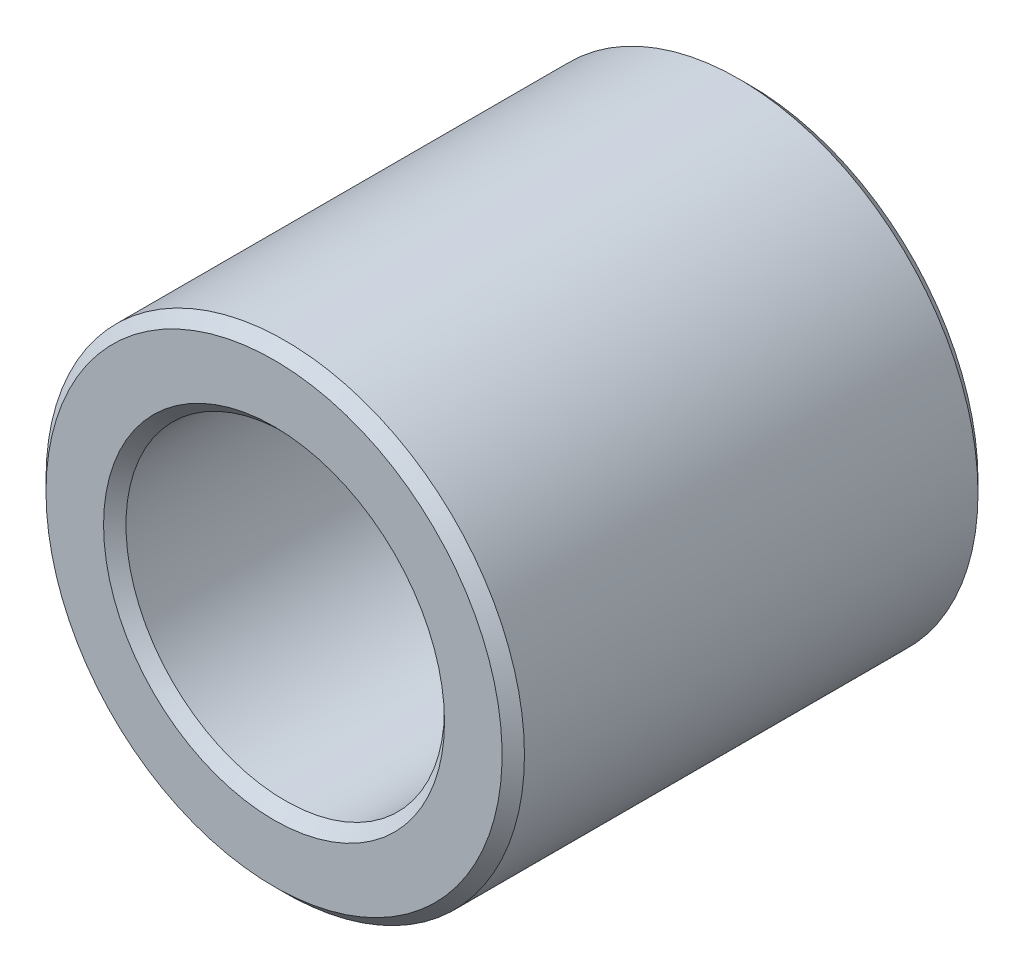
ISO-10303-21;
HEADER;
FILE_DESCRIPTION(('STEP AP214'),'2;1');
FILE_NAME('part.step','',(''),(''),'','','');
FILE_SCHEMA(('AUTOMOTIVE_DESIGN { 1 0 10303 214 1 1 1 1 }'));
ENDSEC;
DATA;
#1=APPLICATION_CONTEXT('core data for automotive mechanical design processes');
#2=APPLICATION_PROTOCOL_DEFINITION('international standard','automotive_design',2000,#1);
#3=PRODUCT_CONTEXT('',#1,'mechanical');
#4=PRODUCT('Part','Part','',(#3));
#5=PRODUCT_RELATED_PRODUCT_CATEGORY('part','',(#4));
#6=PRODUCT_DEFINITION_FORMATION('','',#4);
#7=PRODUCT_DEFINITION_CONTEXT('part definition',#1,'design');
#8=PRODUCT_DEFINITION('design','',#6,#7);
#9=PRODUCT_DEFINITION_SHAPE('','',#8);
#10=(LENGTH_UNIT() NAMED_UNIT(*) SI_UNIT(.MILLI.,.METRE.));
#11=(NAMED_UNIT(*) PLANE_ANGLE_UNIT() SI_UNIT($,.RADIAN.));
#12=(NAMED_UNIT(*) SI_UNIT($,.STERADIAN.) SOLID_ANGLE_UNIT());
#13=UNCERTAINTY_MEASURE_WITH_UNIT(LENGTH_MEASURE(1.E-05),#10,'distance_accuracy_value','');
#14=(GEOMETRIC_REPRESENTATION_CONTEXT(3) GLOBAL_UNCERTAINTY_ASSIGNED_CONTEXT((#13)) GLOBAL_UNIT_ASSIGNED_CONTEXT((#10,
#11,#12)) REPRESENTATION_CONTEXT('',''));
#15=CARTESIAN_POINT('',(0.,0.,0.));
#16=DIRECTION('',(0.,0.,1.));
#17=DIRECTION('',(1.,0.,0.));
#18=AXIS2_PLACEMENT_3D('',#15,#16,#17);
#19=CARTESIAN_POINT('',(0.,0.,-4.7625));
#20=DIRECTION('',(0.,0.,1.));
#21=DIRECTION('',(1.,0.,0.));
#22=AXIS2_PLACEMENT_3D('',#19,#20,#21);
#23=CYLINDRICAL_SURFACE('',#22,4.7879);
#24=CARTESIAN_POINT('',(0.,0.,-4.538472));
#25=DIRECTION('',(0.,0.,1.));
#26=DIRECTION('',(1.,0.,0.));
#27=AXIS2_PLACEMENT_3D('',#24,#25,#26);
#28=CIRCLE('',#27,4.7879);
#29=CARTESIAN_POINT('',(4.7879,0.,-4.538472));
#30=VERTEX_POINT('',#29);
#31=EDGE_CURVE('E78',#30,#30,#28,.T.);
#32=ORIENTED_EDGE('',*,*,#31,.T.);
#33=EDGE_LOOP('',(#32));
#34=FACE_BOUND('',#33,.T.);
#35=CARTESIAN_POINT('',(0.,0.,4.538472));
#36=DIRECTION('',(0.,0.,1.));
#37=DIRECTION('',(1.,0.,0.));
#38=AXIS2_PLACEMENT_3D('',#35,#36,#37);
#39=CIRCLE('',#38,4.7879);
#40=CARTESIAN_POINT('',(-4.7879,0.,4.538472));
#41=VERTEX_POINT('',#40);
#42=EDGE_CURVE('E82',#41,#41,#39,.F.);
#43=ORIENTED_EDGE('',*,*,#42,.T.);
#44=EDGE_LOOP('',(#43));
#45=FACE_BOUND('',#44,.T.);
#46=ADVANCED_FACE('F45',(#34,#45),#23,.T.);
#47=CARTESIAN_POINT('',(0.,0.,-4.7625));
#48=DIRECTION('',(0.,0.,1.));
#49=DIRECTION('',(1.,0.,0.));
#50=AXIS2_PLACEMENT_3D('',#47,#48,#49);
#51=PLANE('',#50);
#52=CARTESIAN_POINT('',(0.,0.,-4.7625));
#53=DIRECTION('',(0.,0.,1.));
#54=DIRECTION('',(1.,0.,0.));
#55=AXIS2_PLACEMENT_3D('',#52,#53,#54);
#56=CIRCLE('',#55,4.563872);
#57=CARTESIAN_POINT('',(4.563872,0.,-4.7625));
#58=VERTEX_POINT('',#57);
#59=EDGE_CURVE('E70',#58,#58,#56,.F.);
#60=ORIENTED_EDGE('',*,*,#59,.T.);
#61=EDGE_LOOP('',(#60));
#62=FACE_BOUND('',#61,.T.);
#63=CARTESIAN_POINT('',(0.,0.,-4.7625));
#64=DIRECTION('',(0.,0.,1.));
#65=DIRECTION('',(1.,0.,0.));
#66=AXIS2_PLACEMENT_3D('',#63,#64,#65);
#67=CIRCLE('',#66,3.411728);
#68=CARTESIAN_POINT('',(3.411728,0.,-4.7625));
#69=VERTEX_POINT('',#68);
#70=EDGE_CURVE('E74',#69,#69,#67,.T.);
#71=ORIENTED_EDGE('',*,*,#70,.T.);
#72=EDGE_LOOP('',(#71));
#73=FACE_BOUND('',#72,.T.);
#74=ADVANCED_FACE('F97',(#62,#73),#51,.F.);
#75=CARTESIAN_POINT('',(0.,0.,-4.7625));
#76=DIRECTION('',(0.,0.,1.));
#77=DIRECTION('',(1.,0.,0.));
#78=AXIS2_PLACEMENT_3D('',#75,#76,#77);
#79=CYLINDRICAL_SURFACE('',#78,3.1877);
#80=CARTESIAN_POINT('',(0.,0.,-4.538472));
#81=DIRECTION('',(0.,0.,1.));
#82=DIRECTION('',(1.,0.,0.));
#83=AXIS2_PLACEMENT_3D('',#80,#81,#82);
#84=CIRCLE('',#83,3.1877);
#85=CARTESIAN_POINT('',(3.1877,0.,-4.538472));
#86=VERTEX_POINT('',#85);
#87=EDGE_CURVE('E59',#86,#86,#84,.F.);
#88=ORIENTED_EDGE('',*,*,#87,.T.);
#89=EDGE_LOOP('',(#88));
#90=FACE_BOUND('',#89,.T.);
#91=CARTESIAN_POINT('',(0.,0.,4.538472));
#92=DIRECTION('',(0.,0.,1.));
#93=DIRECTION('',(1.,0.,0.));
#94=AXIS2_PLACEMENT_3D('',#91,#92,#93);
#95=CIRCLE('',#94,3.1877);
#96=CARTESIAN_POINT('',(3.1877,0.,4.538472));
#97=VERTEX_POINT('',#96);
#98=EDGE_CURVE('E64',#97,#97,#95,.T.);
#99=ORIENTED_EDGE('',*,*,#98,.T.);
#100=EDGE_LOOP('',(#99));
#101=FACE_BOUND('',#100,.T.);
#102=ADVANCED_FACE('F103',(#90,#101),#79,.F.);
#103=CARTESIAN_POINT('',(0.,0.,4.7625));
#104=DIRECTION('',(0.,0.,1.));
#105=DIRECTION('',(1.,0.,0.));
#106=AXIS2_PLACEMENT_3D('',#103,#104,#105);
#107=PLANE('',#106);
#108=CARTESIAN_POINT('',(0.,0.,4.7625));
#109=DIRECTION('',(0.,0.,1.));
#110=DIRECTION('',(1.,0.,0.));
#111=AXIS2_PLACEMENT_3D('',#108,#109,#110);
#112=CIRCLE('',#111,3.411728);
#113=CARTESIAN_POINT('',(3.411728,0.,4.7625));
#114=VERTEX_POINT('',#113);
#115=EDGE_CURVE('E10',#114,#114,#112,.F.);
#116=ORIENTED_EDGE('',*,*,#115,.T.);
#117=EDGE_LOOP('',(#116));
#118=FACE_BOUND('',#117,.T.);
#119=CARTESIAN_POINT('',(0.,0.,4.7625));
#120=DIRECTION('',(0.,0.,1.));
#121=DIRECTION('',(1.,0.,0.));
#122=AXIS2_PLACEMENT_3D('',#119,#120,#121);
#123=CIRCLE('',#122,4.563872);
#124=CARTESIAN_POINT('',(-4.563872,0.,4.7625));
#125=VERTEX_POINT('',#124);
#126=EDGE_CURVE('E54',#125,#125,#123,.T.);
#127=ORIENTED_EDGE('',*,*,#126,.T.);
#128=EDGE_LOOP('',(#127));
#129=FACE_BOUND('',#128,.T.);
#130=ADVANCED_FACE('F115',(#118,#129),#107,.T.);
#131=CARTESIAN_POINT('',(0.,0.,-4.538472));
#132=DIRECTION('',(0.,0.,1.));
#133=DIRECTION('',(1.,0.,0.));
#134=AXIS2_PLACEMENT_3D('',#131,#132,#133);
#135=CONICAL_SURFACE('',#134,4.7879,0.785398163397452);
#136=ORIENTED_EDGE('',*,*,#59,.F.);
#137=EDGE_LOOP('',(#136));
#138=FACE_BOUND('',#137,.T.);
#139=ORIENTED_EDGE('',*,*,#31,.F.);
#140=EDGE_LOOP('',(#139));
#141=FACE_BOUND('',#140,.T.);
#142=ADVANCED_FACE('F109',(#138,#141),#135,.T.);
#143=CARTESIAN_POINT('',(0.,0.,-4.7625));
#144=DIRECTION('',(0.,0.,-1.));
#145=DIRECTION('',(-1.,0.,0.));
#146=AXIS2_PLACEMENT_3D('',#143,#144,#145);
#147=CONICAL_SURFACE('',#146,3.411728,0.78539816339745);
#148=ORIENTED_EDGE('',*,*,#87,.F.);
#149=EDGE_LOOP('',(#148));
#150=FACE_BOUND('',#149,.T.);
#151=ORIENTED_EDGE('',*,*,#70,.F.);
#152=EDGE_LOOP('',(#151));
#153=FACE_BOUND('',#152,.T.);
#154=ADVANCED_FACE('F94',(#150,#153),#147,.F.);
#155=CARTESIAN_POINT('',(0.,0.,4.538472));
#156=DIRECTION('',(0.,0.,1.));
#157=DIRECTION('',(1.,0.,0.));
#158=AXIS2_PLACEMENT_3D('',#155,#156,#157);
#159=CONICAL_SURFACE('',#158,3.1877,0.78539816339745);
#160=CARTESIAN_POINT('',(3.411728,0.,4.7625));
#161=CARTESIAN_POINT('',(3.409394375,0.,4.760166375));
#162=CARTESIAN_POINT('',(3.40706075,0.,4.75783275));
#163=CARTESIAN_POINT('',(3.4023935,0.,4.7531655));
#164=CARTESIAN_POINT('',(3.400059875,0.,4.750831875));
#165=CARTESIAN_POINT('',(3.395392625,0.,4.746164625));
#166=CARTESIAN_POINT('',(3.393059,0.,4.743831));
#167=CARTESIAN_POINT('',(3.38839175,0.,4.73916375));
#168=CARTESIAN_POINT('',(3.386058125,0.,4.736830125));
#169=CARTESIAN_POINT('',(3.381390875,0.,4.732162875));
#170=CARTESIAN_POINT('',(3.37905725,0.,4.72982925));
#171=CARTESIAN_POINT('',(3.37439,0.,4.725162));
#172=CARTESIAN_POINT('',(3.372056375,0.,4.722828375));
#173=CARTESIAN_POINT('',(3.367389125,0.,4.718161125));
#174=CARTESIAN_POINT('',(3.3650555,0.,4.7158275));
#175=CARTESIAN_POINT('',(3.36038825,0.,4.71116025));
#176=CARTESIAN_POINT('',(3.358054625,0.,4.708826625));
#177=CARTESIAN_POINT('',(3.353387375,0.,4.704159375));
#178=CARTESIAN_POINT('',(3.35105375,0.,4.70182575));
#179=CARTESIAN_POINT('',(3.3463865,0.,4.6971585));
#180=CARTESIAN_POINT('',(3.344052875,0.,4.694824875));
#181=CARTESIAN_POINT('',(3.339385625,0.,4.690157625));
#182=CARTESIAN_POINT('',(3.337052,0.,4.687824));
#183=CARTESIAN_POINT('',(3.33238475,0.,4.68315675));
#184=CARTESIAN_POINT('',(3.330051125,0.,4.680823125));
#185=CARTESIAN_POINT('',(3.325383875,0.,4.676155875));
#186=CARTESIAN_POINT('',(3.32305025,0.,4.67382225));
#187=CARTESIAN_POINT('',(3.318383,0.,4.669155));
#188=CARTESIAN_POINT('',(3.316049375,0.,4.666821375));
#189=CARTESIAN_POINT('',(3.311382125,0.,4.662154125));
#190=CARTESIAN_POINT('',(3.3090485,0.,4.6598205));
#191=CARTESIAN_POINT('',(3.30438125,0.,4.65515325));
#192=CARTESIAN_POINT('',(3.302047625,0.,4.652819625));
#193=CARTESIAN_POINT('',(3.297380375,0.,4.648152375));
#194=CARTESIAN_POINT('',(3.29504675,0.,4.64581875));
#195=CARTESIAN_POINT('',(3.2903795,0.,4.6411515));
#196=CARTESIAN_POINT('',(3.288045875,0.,4.638817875));
#197=CARTESIAN_POINT('',(3.283378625,0.,4.634150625));
#198=CARTESIAN_POINT('',(3.281045,0.,4.631817));
#199=CARTESIAN_POINT('',(3.27637775,0.,4.62714975));
#200=CARTESIAN_POINT('',(3.274044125,0.,4.624816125));
#201=CARTESIAN_POINT('',(3.269376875,0.,4.620148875));
#202=CARTESIAN_POINT('',(3.26704325,0.,4.61781525));
#203=CARTESIAN_POINT('',(3.262376,0.,4.613148));
#204=CARTESIAN_POINT('',(3.260042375,0.,4.610814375));
#205=CARTESIAN_POINT('',(3.255375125,0.,4.606147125));
#206=CARTESIAN_POINT('',(3.2530415,0.,4.6038135));
#207=CARTESIAN_POINT('',(3.24837425,0.,4.59914625));
#208=CARTESIAN_POINT('',(3.246040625,0.,4.596812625));
#209=CARTESIAN_POINT('',(3.241373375,0.,4.592145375));
#210=CARTESIAN_POINT('',(3.23903975,0.,4.58981175));
#211=CARTESIAN_POINT('',(3.2343725,0.,4.5851445));
#212=CARTESIAN_POINT('',(3.232038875,0.,4.582810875));
#213=CARTESIAN_POINT('',(3.227371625,0.,4.578143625));
#214=CARTESIAN_POINT('',(3.225038,0.,4.57581));
#215=CARTESIAN_POINT('',(3.22037075,0.,4.57114275));
#216=CARTESIAN_POINT('',(3.218037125,0.,4.568809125));
#217=CARTESIAN_POINT('',(3.213369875,0.,4.564141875));
#218=CARTESIAN_POINT('',(3.21103625,0.,4.56180825));
#219=CARTESIAN_POINT('',(3.206369,0.,4.557141));
#220=CARTESIAN_POINT('',(3.204035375,0.,4.554807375));
#221=CARTESIAN_POINT('',(3.199368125,0.,4.550140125));
#222=CARTESIAN_POINT('',(3.1970345,0.,4.5478065));
#223=CARTESIAN_POINT('',(3.19236725,0.,4.54313925));
#224=CARTESIAN_POINT('',(3.190033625,0.,4.540805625));
#225=CARTESIAN_POINT('',(3.1877,0.,4.538472));
#226=B_SPLINE_CURVE_WITH_KNOTS('',3,(#160,#161,#162,#163,#164,#165,#166,#167,#168,#169,#170,
#171,#172,#173,#174,#175,#176,#177,#178,#179,#180,#181,#182,#183,#184,#185,#186,#187,#188,#189,
#190,#191,#192,#193,#194,#195,#196,#197,#198,#199,#200,#201,#202,#203,#204,#205,#206,#207,#208,
#209,#210,#211,#212,#213,#214,#215,#216,#217,#218,#219,#220,#221,#222,#223,#224,#225),
.UNSPECIFIED.,.F.,.F.,(4,2,2,2,2,2,2,2,2,2,2,2,2,2,2,2,2,2,2,2,2,2,2,2,2,2,2,2,2,2,2,2,4),(0.,
0.00990073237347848,0.0198014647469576,0.0297021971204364,0.0396029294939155,0.049503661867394,
0.059404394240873,0.0693051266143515,0.0792058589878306,0.08910659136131,0.0990073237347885,
0.108908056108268,0.118808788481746,0.128709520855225,0.138610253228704,0.148510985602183,
0.158411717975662,0.168312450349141,0.17821318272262,0.188113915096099,0.198014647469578,
0.207915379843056,0.217816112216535,0.227716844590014,0.237617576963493,0.247518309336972,
0.257419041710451,0.26731977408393,0.277220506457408,0.287121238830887,0.297021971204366,
0.306922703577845,0.316823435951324),.UNSPECIFIED.);
#227=EDGE_CURVE('BSEAM90',#114,#97,#226,.T.);
#228=ORIENTED_EDGE('',*,*,#115,.F.);
#229=ORIENTED_EDGE('',*,*,#98,.F.);
#230=ORIENTED_EDGE('',*,*,#227,.T.);
#231=ORIENTED_EDGE('',*,*,#227,.F.);
#232=EDGE_LOOP('',(#228,#230,#229,#231));
#233=FACE_BOUND('',#232,.T.);
#234=ADVANCED_FACE('F90',(#233),#159,.F.);
#235=CARTESIAN_POINT('',(0.,0.,4.7625));
#236=DIRECTION('',(0.,0.,-1.));
#237=DIRECTION('',(-1.,0.,0.));
#238=AXIS2_PLACEMENT_3D('',#235,#236,#237);
#239=CONICAL_SURFACE('',#238,4.563872,0.78539816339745);
#240=CARTESIAN_POINT('',(-4.7879,0.,4.538472));
#241=CARTESIAN_POINT('',(-4.785566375,0.,4.540805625));
#242=CARTESIAN_POINT('',(-4.78323275,0.,4.54313925));
#243=CARTESIAN_POINT('',(-4.7785655,0.,4.5478065));
#244=CARTESIAN_POINT('',(-4.776231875,0.,4.550140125));
#245=CARTESIAN_POINT('',(-4.771564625,0.,4.554807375));
#246=CARTESIAN_POINT('',(-4.769231,0.,4.557141));
#247=CARTESIAN_POINT('',(-4.76456375,0.,4.56180825));
#248=CARTESIAN_POINT('',(-4.762230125,0.,4.564141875));
#249=CARTESIAN_POINT('',(-4.757562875,0.,4.568809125));
#250=CARTESIAN_POINT('',(-4.75522925,0.,4.57114275));
#251=CARTESIAN_POINT('',(-4.750562,0.,4.57581));
#252=CARTESIAN_POINT('',(-4.748228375,0.,4.578143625));
#253=CARTESIAN_POINT('',(-4.743561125,0.,4.582810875));
#254=CARTESIAN_POINT('',(-4.7412275,0.,4.5851445));
#255=CARTESIAN_POINT('',(-4.73656025,0.,4.58981175));
#256=CARTESIAN_POINT('',(-4.734226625,0.,4.592145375));
#257=CARTESIAN_POINT('',(-4.729559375,0.,4.596812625));
#258=CARTESIAN_POINT('',(-4.72722575,0.,4.59914625));
#259=CARTESIAN_POINT('',(-4.7225585,0.,4.6038135));
#260=CARTESIAN_POINT('',(-4.720224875,0.,4.606147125));
#261=CARTESIAN_POINT('',(-4.715557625,0.,4.610814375));
#262=CARTESIAN_POINT('',(-4.713224,0.,4.613148));
#263=CARTESIAN_POINT('',(-4.70855675,0.,4.61781525));
#264=CARTESIAN_POINT('',(-4.706223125,0.,4.620148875));
#265=CARTESIAN_POINT('',(-4.701555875,0.,4.624816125));
#266=CARTESIAN_POINT('',(-4.69922225,0.,4.62714975));
#267=CARTESIAN_POINT('',(-4.694555,0.,4.631817));
#268=CARTESIAN_POINT('',(-4.692221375,0.,4.634150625));
#269=CARTESIAN_POINT('',(-4.687554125,0.,4.638817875));
#270=CARTESIAN_POINT('',(-4.6852205,0.,4.6411515));
#271=CARTESIAN_POINT('',(-4.68055325,0.,4.64581875));
#272=CARTESIAN_POINT('',(-4.678219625,0.,4.648152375));
#273=CARTESIAN_POINT('',(-4.673552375,0.,4.652819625));
#274=CARTESIAN_POINT('',(-4.67121875,0.,4.65515325));
#275=CARTESIAN_POINT('',(-4.6665515,0.,4.6598205));
#276=CARTESIAN_POINT('',(-4.664217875,0.,4.662154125));
#277=CARTESIAN_POINT('',(-4.659550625,0.,4.666821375));
#278=CARTESIAN_POINT('',(-4.657217,0.,4.669155));
#279=CARTESIAN_POINT('',(-4.65254975,0.,4.67382225));
#280=CARTESIAN_POINT('',(-4.650216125,0.,4.676155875));
#281=CARTESIAN_POINT('',(-4.645548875,0.,4.680823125));
#282=CARTESIAN_POINT('',(-4.64321525,0.,4.68315675));
#283=CARTESIAN_POINT('',(-4.638548,0.,4.687824));
#284=CARTESIAN_POINT('',(-4.636214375,0.,4.690157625));
#285=CARTESIAN_POINT('',(-4.631547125,0.,4.694824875));
#286=CARTESIAN_POINT('',(-4.6292135,0.,4.6971585));
#287=CARTESIAN_POINT('',(-4.62454625,0.,4.70182575));
#288=CARTESIAN_POINT('',(-4.622212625,0.,4.704159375));
#289=CARTESIAN_POINT('',(-4.617545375,0.,4.708826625));
#290=CARTESIAN_POINT('',(-4.61521175,0.,4.71116025));
#291=CARTESIAN_POINT('',(-4.6105445,0.,4.7158275));
#292=CARTESIAN_POINT('',(-4.608210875,0.,4.718161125));
#293=CARTESIAN_POINT('',(-4.603543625,0.,4.722828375));
#294=CARTESIAN_POINT('',(-4.60121,0.,4.725162));
#295=CARTESIAN_POINT('',(-4.59654275,0.,4.72982925));
#296=CARTESIAN_POINT('',(-4.594209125,0.,4.732162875));
#297=CARTESIAN_POINT('',(-4.589541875,0.,4.736830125));
#298=CARTESIAN_POINT('',(-4.58720825,0.,4.73916375));
#299=CARTESIAN_POINT('',(-4.582541,0.,4.743831));
#300=CARTESIAN_POINT('',(-4.580207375,0.,4.746164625));
#301=CARTESIAN_POINT('',(-4.575540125,0.,4.750831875));
#302=CARTESIAN_POINT('',(-4.5732065,0.,4.7531655));
#303=CARTESIAN_POINT('',(-4.56853925,0.,4.75783275));
#304=CARTESIAN_POINT('',(-4.566205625,0.,4.760166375));
#305=CARTESIAN_POINT('',(-4.563872,0.,4.7625));
#306=B_SPLINE_CURVE_WITH_KNOTS('',3,(#240,#241,#242,#243,#244,#245,#246,#247,#248,#249,#250,
#251,#252,#253,#254,#255,#256,#257,#258,#259,#260,#261,#262,#263,#264,#265,#266,#267,#268,#269,
#270,#271,#272,#273,#274,#275,#276,#277,#278,#279,#280,#281,#282,#283,#284,#285,#286,#287,#288,
#289,#290,#291,#292,#293,#294,#295,#296,#297,#298,#299,#300,#301,#302,#303,#304,#305),
.UNSPECIFIED.,.F.,.F.,(4,2,2,2,2,2,2,2,2,2,2,2,2,2,2,2,2,2,2,2,2,2,2,2,2,2,2,2,2,2,2,2,4),(0.,
0.0099007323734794,0.0198014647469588,0.029702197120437,0.0396029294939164,0.0495036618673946,
0.059404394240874,0.0693051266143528,0.0792058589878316,0.089106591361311,0.0990073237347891,
0.108908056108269,0.118808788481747,0.128709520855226,0.138610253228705,0.148510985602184,
0.158411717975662,0.168312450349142,0.178213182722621,0.188113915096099,0.198014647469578,
0.207915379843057,0.217816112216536,0.227716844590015,0.237617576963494,0.247518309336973,
0.257419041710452,0.267319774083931,0.277220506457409,0.287121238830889,0.297021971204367,
0.306922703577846,0.316823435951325),.UNSPECIFIED.);
#307=EDGE_CURVE('BSEAM48',#41,#125,#306,.T.);
#308=ORIENTED_EDGE('',*,*,#42,.F.);
#309=ORIENTED_EDGE('',*,*,#126,.F.);
#310=ORIENTED_EDGE('',*,*,#307,.T.);
#311=ORIENTED_EDGE('',*,*,#307,.F.);
#312=EDGE_LOOP('',(#308,#310,#309,#311));
#313=FACE_BOUND('',#312,.T.);
#314=ADVANCED_FACE('F48',(#313),#239,.T.);
#315=CLOSED_SHELL('',(#46,#74,#102,#130,#142,#154,#234,#314));
#316=MANIFOLD_SOLID_BREP('B2',#315);
#317=ADVANCED_BREP_SHAPE_REPRESENTATION('',(#18,#316),#14);
#318=SHAPE_DEFINITION_REPRESENTATION(#9,#317);
ENDSEC;
END-ISO-10303-21;
